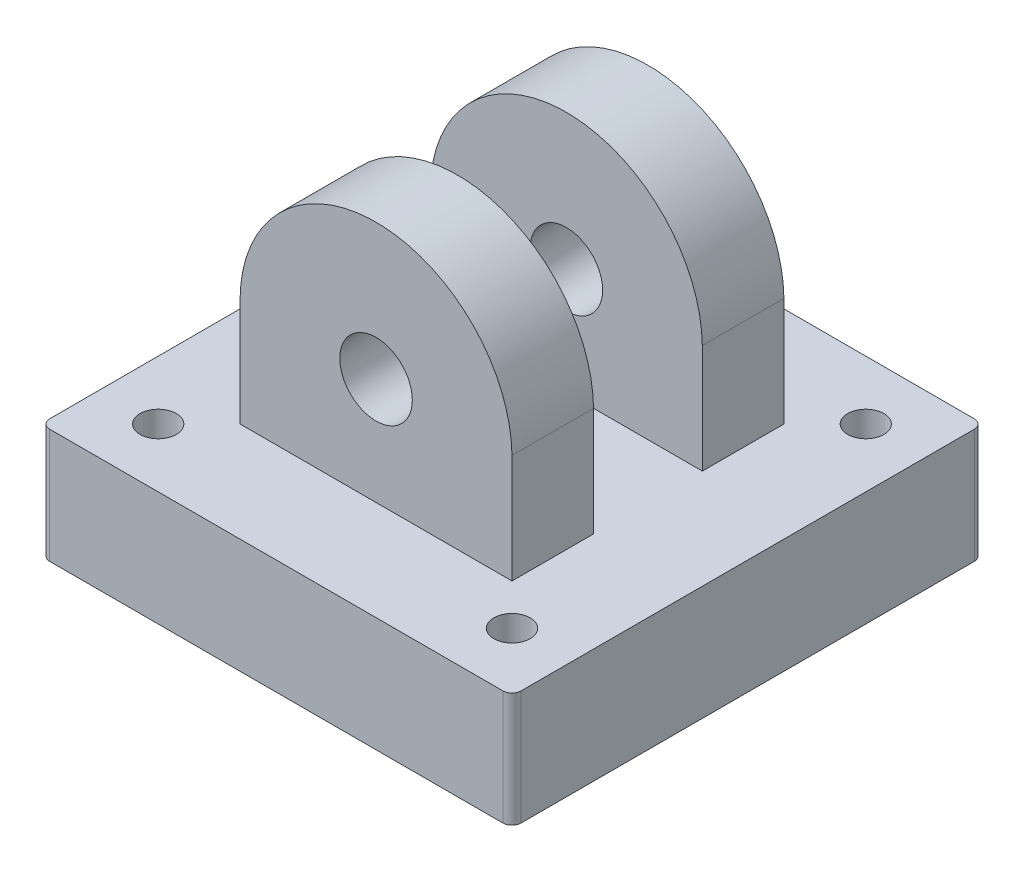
ISO-10303-21;
HEADER;
FILE_DESCRIPTION(('STEP AP214'),'2;1');
FILE_NAME('part.step','',(''),(''),'','','');
FILE_SCHEMA(('AUTOMOTIVE_DESIGN { 1 0 10303 214 1 1 1 1 }'));
ENDSEC;
DATA;
#1=APPLICATION_CONTEXT('core data for automotive mechanical design processes');
#2=APPLICATION_PROTOCOL_DEFINITION('international standard','automotive_design',2000,#1);
#3=PRODUCT_CONTEXT('',#1,'mechanical');
#4=PRODUCT('Part','Part','',(#3));
#5=PRODUCT_RELATED_PRODUCT_CATEGORY('part','',(#4));
#6=PRODUCT_DEFINITION_FORMATION('','',#4);
#7=PRODUCT_DEFINITION_CONTEXT('part definition',#1,'design');
#8=PRODUCT_DEFINITION('design','',#6,#7);
#9=PRODUCT_DEFINITION_SHAPE('','',#8);
#10=(LENGTH_UNIT() NAMED_UNIT(*) SI_UNIT(.MILLI.,.METRE.));
#11=(NAMED_UNIT(*) PLANE_ANGLE_UNIT() SI_UNIT($,.RADIAN.));
#12=(NAMED_UNIT(*) SI_UNIT($,.STERADIAN.) SOLID_ANGLE_UNIT());
#13=UNCERTAINTY_MEASURE_WITH_UNIT(LENGTH_MEASURE(1.E-05),#10,'distance_accuracy_value','');
#14=(GEOMETRIC_REPRESENTATION_CONTEXT(3) GLOBAL_UNCERTAINTY_ASSIGNED_CONTEXT((#13)) GLOBAL_UNIT_ASSIGNED_CONTEXT((#10,
#11,#12)) REPRESENTATION_CONTEXT('',''));
#15=CARTESIAN_POINT('',(0.,0.,0.));
#16=DIRECTION('',(0.,0.,1.));
#17=DIRECTION('',(1.,0.,0.));
#18=AXIS2_PLACEMENT_3D('',#15,#16,#17);
#19=CARTESIAN_POINT('',(47.625,76.2,-47.625));
#20=DIRECTION('',(-1.,0.,0.));
#21=DIRECTION('',(0.,0.,1.));
#22=AXIS2_PLACEMENT_3D('',#19,#20,#21);
#23=PLANE('',#22);
#24=DIRECTION('',(0.,0.,-1.));
#25=VECTOR('',#24,1.);
#26=CARTESIAN_POINT('',(47.625,76.2,-47.625));
#27=LINE('',#26,#25);
#28=CARTESIAN_POINT('',(47.625,76.2,-19.045));
#29=VERTEX_POINT('',#28);
#30=CARTESIAN_POINT('',(47.625,76.2,-47.625));
#31=VERTEX_POINT('',#30);
#32=EDGE_CURVE('E185',#29,#31,#27,.T.);
#33=ORIENTED_EDGE('',*,*,#32,.F.);
#34=DIRECTION('',(0.,-1.,0.));
#35=VECTOR('',#34,1.);
#36=CARTESIAN_POINT('',(47.625,76.2,-19.045));
#37=LINE('',#36,#35);
#38=CARTESIAN_POINT('',(47.625,38.1,-19.045));
#39=VERTEX_POINT('',#38);
#40=EDGE_CURVE('E352',#29,#39,#37,.T.);
#41=ORIENTED_EDGE('',*,*,#40,.T.);
#42=DIRECTION('',(0.,0.,-1.));
#43=VECTOR('',#42,1.);
#44=CARTESIAN_POINT('',(47.625,38.1,-47.625));
#45=LINE('',#44,#43);
#46=CARTESIAN_POINT('',(47.625,38.1,-47.625));
#47=VERTEX_POINT('',#46);
#48=EDGE_CURVE('E163',#39,#47,#45,.T.);
#49=ORIENTED_EDGE('',*,*,#48,.T.);
#50=DIRECTION('',(0.,-1.,0.));
#51=VECTOR('',#50,1.);
#52=CARTESIAN_POINT('',(47.625,76.2,-47.625));
#53=LINE('',#52,#51);
#54=EDGE_CURVE('E199',#31,#47,#53,.T.);
#55=ORIENTED_EDGE('',*,*,#54,.F.);
#56=EDGE_LOOP('',(#33,#41,#49,#55));
#57=FACE_BOUND('',#56,.T.);
#58=ADVANCED_FACE('F35',(#57),#23,.F.);
#59=CARTESIAN_POINT('',(-47.625,76.2,-47.625));
#60=DIRECTION('',(1.,0.,0.));
#61=DIRECTION('',(0.,0.,-1.));
#62=AXIS2_PLACEMENT_3D('',#59,#60,#61);
#63=PLANE('',#62);
#64=DIRECTION('',(0.,0.,1.));
#65=VECTOR('',#64,1.);
#66=CARTESIAN_POINT('',(-47.625,38.1,-47.625));
#67=LINE('',#66,#65);
#68=CARTESIAN_POINT('',(-47.625,38.1,-47.625));
#69=VERTEX_POINT('',#68);
#70=CARTESIAN_POINT('',(-47.625,38.1,-19.045));
#71=VERTEX_POINT('',#70);
#72=EDGE_CURVE('E162',#69,#71,#67,.T.);
#73=ORIENTED_EDGE('',*,*,#72,.T.);
#74=DIRECTION('',(0.,-1.,0.));
#75=VECTOR('',#74,1.);
#76=CARTESIAN_POINT('',(-47.625,38.1,-19.045));
#77=LINE('',#76,#75);
#78=CARTESIAN_POINT('',(-47.625,76.1999999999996,-19.045));
#79=VERTEX_POINT('',#78);
#80=EDGE_CURVE('E171',#79,#71,#77,.T.);
#81=ORIENTED_EDGE('',*,*,#80,.F.);
#82=DIRECTION('',(0.,0.,1.));
#83=VECTOR('',#82,1.);
#84=CARTESIAN_POINT('',(-47.625,76.2,-47.625));
#85=LINE('',#84,#83);
#86=CARTESIAN_POINT('',(-47.625,76.2,-47.625));
#87=VERTEX_POINT('',#86);
#88=EDGE_CURVE('E195',#87,#79,#85,.T.);
#89=ORIENTED_EDGE('',*,*,#88,.F.);
#90=DIRECTION('',(0.,-1.,0.));
#91=VECTOR('',#90,1.);
#92=CARTESIAN_POINT('',(-47.625,76.2,-47.625));
#93=LINE('',#92,#91);
#94=EDGE_CURVE('E181',#87,#69,#93,.T.);
#95=ORIENTED_EDGE('',*,*,#94,.T.);
#96=EDGE_LOOP('',(#73,#81,#89,#95));
#97=FACE_BOUND('',#96,.T.);
#98=ADVANCED_FACE('F180',(#97),#63,.F.);
#99=CARTESIAN_POINT('',(0.,75.5098732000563,-47.625));
#100=DIRECTION('',(0.,0.,1.));
#101=DIRECTION('',(1.,0.,0.));
#102=AXIS2_PLACEMENT_3D('',#99,#100,#101);
#103=CYLINDRICAL_SURFACE('',#102,47.63);
#104=CARTESIAN_POINT('',(0.,75.5098732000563,-19.045));
#105=DIRECTION('',(0.,0.,-1.));
#106=DIRECTION('',(-1.,0.,0.));
#107=AXIS2_PLACEMENT_3D('',#104,#105,#106);
#108=CIRCLE('',#107,47.63);
#109=EDGE_CURVE('E173',#29,#79,#108,.F.);
#110=ORIENTED_EDGE('',*,*,#109,.F.);
#111=ORIENTED_EDGE('',*,*,#32,.T.);
#112=CARTESIAN_POINT('',(0.,75.5098732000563,-47.625));
#113=DIRECTION('',(0.,0.,1.));
#114=DIRECTION('',(1.,0.,0.));
#115=AXIS2_PLACEMENT_3D('',#112,#113,#114);
#116=CIRCLE('',#115,47.63);
#117=EDGE_CURVE('E335',#31,#87,#116,.T.);
#118=ORIENTED_EDGE('',*,*,#117,.T.);
#119=ORIENTED_EDGE('',*,*,#88,.T.);
#120=EDGE_LOOP('',(#110,#111,#118,#119));
#121=FACE_BOUND('',#120,.T.);
#122=ADVANCED_FACE('F308',(#121),#103,.T.);
#123=CARTESIAN_POINT('',(0.,75.5098732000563,-82.55));
#124=DIRECTION('',(0.,0.,1.));
#125=DIRECTION('',(1.,0.,0.));
#126=AXIS2_PLACEMENT_3D('',#123,#124,#125);
#127=CYLINDRICAL_SURFACE('',#126,12.7);
#128=CARTESIAN_POINT('',(0.,75.5098732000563,-19.045));
#129=DIRECTION('',(0.,0.,-1.));
#130=DIRECTION('',(-1.,0.,0.));
#131=AXIS2_PLACEMENT_3D('',#128,#129,#130);
#132=CIRCLE('',#131,12.7);
#133=CARTESIAN_POINT('',(-12.7,75.5098732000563,-19.045));
#134=VERTEX_POINT('',#133);
#135=EDGE_CURVE('E230',#134,#134,#132,.F.);
#136=ORIENTED_EDGE('',*,*,#135,.T.);
#137=EDGE_LOOP('',(#136));
#138=FACE_BOUND('',#137,.T.);
#139=CARTESIAN_POINT('',(0.,75.5098732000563,-47.625));
#140=DIRECTION('',(0.,0.,1.));
#141=DIRECTION('',(1.,0.,0.));
#142=AXIS2_PLACEMENT_3D('',#139,#140,#141);
#143=CIRCLE('',#142,12.7);
#144=CARTESIAN_POINT('',(12.7,75.5098732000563,-47.625));
#145=VERTEX_POINT('',#144);
#146=EDGE_CURVE('E344',#145,#145,#143,.T.);
#147=ORIENTED_EDGE('',*,*,#146,.F.);
#148=EDGE_LOOP('',(#147));
#149=FACE_BOUND('',#148,.T.);
#150=ADVANCED_FACE('F536',(#138,#149),#127,.F.);
#151=CARTESIAN_POINT('',(0.,38.1,0.));
#152=DIRECTION('',(0.,1.,0.));
#153=DIRECTION('',(0.,0.,1.));
#154=AXIS2_PLACEMENT_3D('',#151,#152,#153);
#155=PLANE('',#154);
#156=CARTESIAN_POINT('',(61.9637672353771,38.1,61.9637672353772));
#157=DIRECTION('',(0.,1.,0.));
#158=DIRECTION('',(0.,0.,1.));
#159=AXIS2_PLACEMENT_3D('',#156,#157,#158);
#160=CIRCLE('',#159,6.35);
#161=CARTESIAN_POINT('',(61.9637672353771,38.1,68.3137672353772));
#162=VERTEX_POINT('',#161);
#163=EDGE_CURVE('E388',#162,#162,#160,.T.);
#164=ORIENTED_EDGE('',*,*,#163,.F.);
#165=EDGE_LOOP('',(#164));
#166=FACE_BOUND('',#165,.T.);
#167=CARTESIAN_POINT('',(61.9637672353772,38.1,-61.9637672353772));
#168=DIRECTION('',(0.,1.,0.));
#169=DIRECTION('',(0.,0.,1.));
#170=AXIS2_PLACEMENT_3D('',#167,#168,#169);
#171=CIRCLE('',#170,6.35);
#172=CARTESIAN_POINT('',(61.9637672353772,38.1,-55.6137672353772));
#173=VERTEX_POINT('',#172);
#174=EDGE_CURVE('E391',#173,#173,#171,.T.);
#175=ORIENTED_EDGE('',*,*,#174,.F.);
#176=EDGE_LOOP('',(#175));
#177=FACE_BOUND('',#176,.T.);
#178=CARTESIAN_POINT('',(-61.9637672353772,38.1,-61.9637672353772));
#179=DIRECTION('',(0.,1.,0.));
#180=DIRECTION('',(0.,0.,1.));
#181=AXIS2_PLACEMENT_3D('',#178,#179,#180);
#182=CIRCLE('',#181,6.35);
#183=CARTESIAN_POINT('',(-61.9637672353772,38.1,-55.6137672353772));
#184=VERTEX_POINT('',#183);
#185=EDGE_CURVE('E394',#184,#184,#182,.T.);
#186=ORIENTED_EDGE('',*,*,#185,.F.);
#187=EDGE_LOOP('',(#186));
#188=FACE_BOUND('',#187,.T.);
#189=CARTESIAN_POINT('',(-61.9637672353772,38.1,61.9637672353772));
#190=DIRECTION('',(0.,1.,0.));
#191=DIRECTION('',(0.,0.,1.));
#192=AXIS2_PLACEMENT_3D('',#189,#190,#191);
#193=CIRCLE('',#192,6.35);
#194=CARTESIAN_POINT('',(-61.9637672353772,38.1,68.3137672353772));
#195=VERTEX_POINT('',#194);
#196=EDGE_CURVE('E382',#195,#195,#193,.T.);
#197=ORIENTED_EDGE('',*,*,#196,.F.);
#198=EDGE_LOOP('',(#197));
#199=FACE_BOUND('',#198,.T.);
#200=ORIENTED_EDGE('',*,*,#48,.F.);
#201=DIRECTION('',(-1.,0.,0.));
#202=VECTOR('',#201,1.);
#203=CARTESIAN_POINT('',(82.55,38.1,-19.045));
#204=LINE('',#203,#202);
#205=EDGE_CURVE('E156',#39,#71,#204,.T.);
#206=ORIENTED_EDGE('',*,*,#205,.T.);
#207=ORIENTED_EDGE('',*,*,#72,.F.);
#208=DIRECTION('',(-1.,0.,0.));
#209=VECTOR('',#208,1.);
#210=CARTESIAN_POINT('',(-47.625,38.1,-47.625));
#211=LINE('',#210,#209);
#212=EDGE_CURVE('E187',#47,#69,#211,.T.);
#213=ORIENTED_EDGE('',*,*,#212,.F.);
#214=EDGE_LOOP('',(#200,#206,#207,#213));
#215=FACE_BOUND('',#214,.T.);
#216=DIRECTION('',(0.,0.,-1.));
#217=VECTOR('',#216,1.);
#218=CARTESIAN_POINT('',(82.55,38.1,-82.55));
#219=LINE('',#218,#217);
#220=CARTESIAN_POINT('',(82.55,38.1,79.375));
#221=VERTEX_POINT('',#220);
#222=CARTESIAN_POINT('',(82.55,38.1,-79.375));
#223=VERTEX_POINT('',#222);
#224=EDGE_CURVE('E202',#221,#223,#219,.T.);
#225=ORIENTED_EDGE('',*,*,#224,.T.);
#226=CARTESIAN_POINT('',(79.375,38.1,-79.375));
#227=DIRECTION('',(0.,1.,0.));
#228=DIRECTION('',(0.,0.,1.));
#229=AXIS2_PLACEMENT_3D('',#226,#227,#228);
#230=CIRCLE('',#229,3.175);
#231=CARTESIAN_POINT('',(79.375,38.1,-82.55));
#232=VERTEX_POINT('',#231);
#233=EDGE_CURVE('E244',#223,#232,#230,.T.);
#234=ORIENTED_EDGE('',*,*,#233,.T.);
#235=DIRECTION('',(-1.,0.,0.));
#236=VECTOR('',#235,1.);
#237=CARTESIAN_POINT('',(-82.55,38.1,-82.55));
#238=LINE('',#237,#236);
#239=CARTESIAN_POINT('',(-79.375,38.1,-82.55));
#240=VERTEX_POINT('',#239);
#241=EDGE_CURVE('E205',#232,#240,#238,.T.);
#242=ORIENTED_EDGE('',*,*,#241,.T.);
#243=CARTESIAN_POINT('',(-79.375,38.1,-79.375));
#244=DIRECTION('',(0.,1.,0.));
#245=DIRECTION('',(0.,0.,1.));
#246=AXIS2_PLACEMENT_3D('',#243,#244,#245);
#247=CIRCLE('',#246,3.175);
#248=CARTESIAN_POINT('',(-82.55,38.1,-79.375));
#249=VERTEX_POINT('',#248);
#250=EDGE_CURVE('E242',#240,#249,#247,.T.);
#251=ORIENTED_EDGE('',*,*,#250,.T.);
#252=DIRECTION('',(0.,0.,1.));
#253=VECTOR('',#252,1.);
#254=CARTESIAN_POINT('',(-82.55,38.1,-82.55));
#255=LINE('',#254,#253);
#256=CARTESIAN_POINT('',(-82.55,38.1,79.375));
#257=VERTEX_POINT('',#256);
#258=EDGE_CURVE('E208',#249,#257,#255,.T.);
#259=ORIENTED_EDGE('',*,*,#258,.T.);
#260=CARTESIAN_POINT('',(-79.375,38.1,79.375));
#261=DIRECTION('',(0.,1.,0.));
#262=DIRECTION('',(0.,0.,1.));
#263=AXIS2_PLACEMENT_3D('',#260,#261,#262);
#264=CIRCLE('',#263,3.175);
#265=CARTESIAN_POINT('',(-79.375,38.1,82.55));
#266=VERTEX_POINT('',#265);
#267=EDGE_CURVE('E238',#257,#266,#264,.T.);
#268=ORIENTED_EDGE('',*,*,#267,.T.);
#269=DIRECTION('',(1.,0.,0.));
#270=VECTOR('',#269,1.);
#271=CARTESIAN_POINT('',(-82.55,38.1,82.55));
#272=LINE('',#271,#270);
#273=CARTESIAN_POINT('',(79.375,38.1,82.55));
#274=VERTEX_POINT('',#273);
#275=EDGE_CURVE('E211',#266,#274,#272,.T.);
#276=ORIENTED_EDGE('',*,*,#275,.T.);
#277=CARTESIAN_POINT('',(79.375,38.1,79.375));
#278=DIRECTION('',(0.,1.,0.));
#279=DIRECTION('',(0.,0.,1.));
#280=AXIS2_PLACEMENT_3D('',#277,#278,#279);
#281=CIRCLE('',#280,3.175);
#282=EDGE_CURVE('E240',#274,#221,#281,.T.);
#283=ORIENTED_EDGE('',*,*,#282,.T.);
#284=EDGE_LOOP('',(#225,#234,#242,#251,#259,#268,#276,#283));
#285=FACE_BOUND('',#284,.T.);
#286=DIRECTION('',(-1.,0.,0.));
#287=VECTOR('',#286,1.);
#288=CARTESIAN_POINT('',(82.55,38.1,19.055));
#289=LINE('',#288,#287);
#290=CARTESIAN_POINT('',(47.625,38.1,19.055));
#291=VERTEX_POINT('',#290);
#292=CARTESIAN_POINT('',(-47.625,38.1,19.055));
#293=VERTEX_POINT('',#292);
#294=EDGE_CURVE('E167',#291,#293,#289,.T.);
#295=ORIENTED_EDGE('',*,*,#294,.F.);
#296=CARTESIAN_POINT('',(47.625,38.1,47.625));
#297=VERTEX_POINT('',#296);
#298=EDGE_CURVE('E329',#297,#291,#45,.T.);
#299=ORIENTED_EDGE('',*,*,#298,.F.);
#300=DIRECTION('',(1.,0.,0.));
#301=VECTOR('',#300,1.);
#302=CARTESIAN_POINT('',(-47.625,38.1,47.625));
#303=LINE('',#302,#301);
#304=CARTESIAN_POINT('',(-47.625,38.1,47.625));
#305=VERTEX_POINT('',#304);
#306=EDGE_CURVE('E182',#305,#297,#303,.T.);
#307=ORIENTED_EDGE('',*,*,#306,.F.);
#308=EDGE_CURVE('E183',#293,#305,#67,.T.);
#309=ORIENTED_EDGE('',*,*,#308,.F.);
#310=EDGE_LOOP('',(#295,#299,#307,#309));
#311=FACE_BOUND('',#310,.T.);
#312=ADVANCED_FACE('F158',(#166,#177,#188,#199,#215,#285,#311),#155,.T.);
#313=CARTESIAN_POINT('',(82.55,-2.,-82.55));
#314=DIRECTION('',(1.,0.,0.));
#315=DIRECTION('',(0.,0.,-1.));
#316=AXIS2_PLACEMENT_3D('',#313,#314,#315);
#317=PLANE('',#316);
#318=DIRECTION('',(0.,0.,-1.));
#319=VECTOR('',#318,1.);
#320=CARTESIAN_POINT('',(82.55,-2.,-82.55));
#321=LINE('',#320,#319);
#322=CARTESIAN_POINT('',(82.55,-2.,79.375));
#323=VERTEX_POINT('',#322);
#324=CARTESIAN_POINT('',(82.55,-2.,-79.375));
#325=VERTEX_POINT('',#324);
#326=EDGE_CURVE('E214',#323,#325,#321,.T.);
#327=ORIENTED_EDGE('',*,*,#326,.T.);
#328=DIRECTION('',(0.,1.,0.));
#329=VECTOR('',#328,1.);
#330=CARTESIAN_POINT('',(82.55,-2.,-79.375));
#331=LINE('',#330,#329);
#332=EDGE_CURVE('E235',#325,#223,#331,.T.);
#333=ORIENTED_EDGE('',*,*,#332,.T.);
#334=ORIENTED_EDGE('',*,*,#224,.F.);
#335=DIRECTION('',(0.,1.,0.));
#336=VECTOR('',#335,1.);
#337=CARTESIAN_POINT('',(82.55,-2.,79.375));
#338=LINE('',#337,#336);
#339=EDGE_CURVE('E225',#221,#323,#338,.F.);
#340=ORIENTED_EDGE('',*,*,#339,.T.);
#341=EDGE_LOOP('',(#327,#333,#334,#340));
#342=FACE_BOUND('',#341,.T.);
#343=ADVANCED_FACE('F428',(#342),#317,.T.);
#344=CARTESIAN_POINT('',(-82.55,-2.,82.55));
#345=DIRECTION('',(0.,0.,1.));
#346=DIRECTION('',(1.,0.,0.));
#347=AXIS2_PLACEMENT_3D('',#344,#345,#346);
#348=PLANE('',#347);
#349=DIRECTION('',(1.,0.,0.));
#350=VECTOR('',#349,1.);
#351=CARTESIAN_POINT('',(-82.55,-2.,82.55));
#352=LINE('',#351,#350);
#353=CARTESIAN_POINT('',(-79.375,-2.,82.55));
#354=VERTEX_POINT('',#353);
#355=CARTESIAN_POINT('',(79.375,-2.,82.55));
#356=VERTEX_POINT('',#355);
#357=EDGE_CURVE('E222',#354,#356,#352,.T.);
#358=ORIENTED_EDGE('',*,*,#357,.T.);
#359=DIRECTION('',(0.,1.,0.));
#360=VECTOR('',#359,1.);
#361=CARTESIAN_POINT('',(79.375,-2.,82.55));
#362=LINE('',#361,#360);
#363=EDGE_CURVE('E11',#356,#274,#362,.T.);
#364=ORIENTED_EDGE('',*,*,#363,.T.);
#365=ORIENTED_EDGE('',*,*,#275,.F.);
#366=DIRECTION('',(0.,1.,0.));
#367=VECTOR('',#366,1.);
#368=CARTESIAN_POINT('',(-79.375,-2.,82.55));
#369=LINE('',#368,#367);
#370=EDGE_CURVE('E48',#266,#354,#369,.F.);
#371=ORIENTED_EDGE('',*,*,#370,.T.);
#372=EDGE_LOOP('',(#358,#364,#365,#371));
#373=FACE_BOUND('',#372,.T.);
#374=ADVANCED_FACE('F437',(#373),#348,.T.);
#375=CARTESIAN_POINT('',(-82.55,-2.,-82.55));
#376=DIRECTION('',(-1.,0.,0.));
#377=DIRECTION('',(0.,0.,1.));
#378=AXIS2_PLACEMENT_3D('',#375,#376,#377);
#379=PLANE('',#378);
#380=CARTESIAN_POINT('',(-82.55,18.05,0.));
#381=DIRECTION('',(-1.,0.,0.));
#382=DIRECTION('',(0.,0.,1.));
#383=AXIS2_PLACEMENT_3D('',#380,#381,#382);
#384=CIRCLE('',#383,11.0871);
#385=CARTESIAN_POINT('',(-82.55,18.05,11.0871));
#386=VERTEX_POINT('',#385);
#387=EDGE_CURVE('E376',#386,#386,#384,.T.);
#388=ORIENTED_EDGE('',*,*,#387,.F.);
#389=EDGE_LOOP('',(#388));
#390=FACE_BOUND('',#389,.T.);
#391=ORIENTED_EDGE('',*,*,#258,.F.);
#392=DIRECTION('',(0.,1.,0.));
#393=VECTOR('',#392,1.);
#394=CARTESIAN_POINT('',(-82.55,-2.,-79.375));
#395=LINE('',#394,#393);
#396=CARTESIAN_POINT('',(-82.55,-2.,-79.375));
#397=VERTEX_POINT('',#396);
#398=EDGE_CURVE('E63',#249,#397,#395,.F.);
#399=ORIENTED_EDGE('',*,*,#398,.T.);
#400=DIRECTION('',(0.,0.,1.));
#401=VECTOR('',#400,1.);
#402=CARTESIAN_POINT('',(-82.55,-2.,-82.55));
#403=LINE('',#402,#401);
#404=CARTESIAN_POINT('',(-82.55,-2.,79.375));
#405=VERTEX_POINT('',#404);
#406=EDGE_CURVE('E220',#397,#405,#403,.T.);
#407=ORIENTED_EDGE('',*,*,#406,.T.);
#408=DIRECTION('',(0.,1.,0.));
#409=VECTOR('',#408,1.);
#410=CARTESIAN_POINT('',(-82.55,-2.,79.375));
#411=LINE('',#410,#409);
#412=EDGE_CURVE('E258',#405,#257,#411,.T.);
#413=ORIENTED_EDGE('',*,*,#412,.T.);
#414=EDGE_LOOP('',(#391,#399,#407,#413));
#415=FACE_BOUND('',#414,.T.);
#416=ADVANCED_FACE('F441',(#390,#415),#379,.T.);
#417=CARTESIAN_POINT('',(-82.55,-2.,-82.55));
#418=DIRECTION('',(0.,0.,-1.));
#419=DIRECTION('',(-1.,0.,0.));
#420=AXIS2_PLACEMENT_3D('',#417,#418,#419);
#421=PLANE('',#420);
#422=ORIENTED_EDGE('',*,*,#241,.F.);
#423=DIRECTION('',(0.,1.,0.));
#424=VECTOR('',#423,1.);
#425=CARTESIAN_POINT('',(79.375,-2.,-82.55));
#426=LINE('',#425,#424);
#427=CARTESIAN_POINT('',(79.375,-2.,-82.55));
#428=VERTEX_POINT('',#427);
#429=EDGE_CURVE('E249',#232,#428,#426,.F.);
#430=ORIENTED_EDGE('',*,*,#429,.T.);
#431=DIRECTION('',(-1.,0.,0.));
#432=VECTOR('',#431,1.);
#433=CARTESIAN_POINT('',(-82.55,-2.,-82.55));
#434=LINE('',#433,#432);
#435=CARTESIAN_POINT('',(-79.375,-2.,-82.55));
#436=VERTEX_POINT('',#435);
#437=EDGE_CURVE('E217',#428,#436,#434,.T.);
#438=ORIENTED_EDGE('',*,*,#437,.T.);
#439=DIRECTION('',(0.,1.,0.));
#440=VECTOR('',#439,1.);
#441=CARTESIAN_POINT('',(-79.375,-2.,-82.55));
#442=LINE('',#441,#440);
#443=EDGE_CURVE('E246',#436,#240,#442,.T.);
#444=ORIENTED_EDGE('',*,*,#443,.T.);
#445=EDGE_LOOP('',(#422,#430,#438,#444));
#446=FACE_BOUND('',#445,.T.);
#447=ADVANCED_FACE('F323',(#446),#421,.T.);
#448=CARTESIAN_POINT('',(0.,-2.,0.));
#449=DIRECTION('',(0.,1.,0.));
#450=DIRECTION('',(0.,0.,1.));
#451=AXIS2_PLACEMENT_3D('',#448,#449,#450);
#452=PLANE('',#451);
#453=CARTESIAN_POINT('',(61.9637672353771,-2.,61.9637672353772));
#454=DIRECTION('',(0.,-1.,0.));
#455=DIRECTION('',(0.,0.,-1.));
#456=AXIS2_PLACEMENT_3D('',#453,#454,#455);
#457=CIRCLE('',#456,6.35);
#458=CARTESIAN_POINT('',(61.9637672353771,-2.,55.6137672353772));
#459=VERTEX_POINT('',#458);
#460=EDGE_CURVE('E397',#459,#459,#457,.T.);
#461=ORIENTED_EDGE('',*,*,#460,.F.);
#462=EDGE_LOOP('',(#461));
#463=FACE_BOUND('',#462,.T.);
#464=CARTESIAN_POINT('',(61.9637672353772,-2.,-61.9637672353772));
#465=DIRECTION('',(0.,-1.,0.));
#466=DIRECTION('',(0.,0.,-1.));
#467=AXIS2_PLACEMENT_3D('',#464,#465,#466);
#468=CIRCLE('',#467,6.35);
#469=CARTESIAN_POINT('',(61.9637672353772,-2.,-68.3137672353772));
#470=VERTEX_POINT('',#469);
#471=EDGE_CURVE('E401',#470,#470,#468,.T.);
#472=ORIENTED_EDGE('',*,*,#471,.F.);
#473=EDGE_LOOP('',(#472));
#474=FACE_BOUND('',#473,.T.);
#475=CARTESIAN_POINT('',(-61.9637672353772,-2.,-61.9637672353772));
#476=DIRECTION('',(0.,-1.,0.));
#477=DIRECTION('',(0.,0.,-1.));
#478=AXIS2_PLACEMENT_3D('',#475,#476,#477);
#479=CIRCLE('',#478,6.35);
#480=CARTESIAN_POINT('',(-61.9637672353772,-2.,-68.3137672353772));
#481=VERTEX_POINT('',#480);
#482=EDGE_CURVE('E398',#481,#481,#479,.T.);
#483=ORIENTED_EDGE('',*,*,#482,.F.);
#484=EDGE_LOOP('',(#483));
#485=FACE_BOUND('',#484,.T.);
#486=CARTESIAN_POINT('',(-61.9637672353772,-2.,61.9637672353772));
#487=DIRECTION('',(0.,-1.,0.));
#488=DIRECTION('',(0.,0.,-1.));
#489=AXIS2_PLACEMENT_3D('',#486,#487,#488);
#490=CIRCLE('',#489,6.35);
#491=CARTESIAN_POINT('',(-61.9637672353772,-2.,55.6137672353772));
#492=VERTEX_POINT('',#491);
#493=EDGE_CURVE('E385',#492,#492,#490,.T.);
#494=ORIENTED_EDGE('',*,*,#493,.F.);
#495=EDGE_LOOP('',(#494));
#496=FACE_BOUND('',#495,.T.);
#497=CARTESIAN_POINT('',(0.,-2.,0.));
#498=DIRECTION('',(0.,-1.,0.));
#499=DIRECTION('',(0.,0.,-1.));
#500=AXIS2_PLACEMENT_3D('',#497,#498,#499);
#501=CIRCLE('',#500,76.2);
#502=CARTESIAN_POINT('',(0.,-2.,-76.2));
#503=VERTEX_POINT('',#502);
#504=EDGE_CURVE('E364',#503,#503,#501,.T.);
#505=ORIENTED_EDGE('',*,*,#504,.F.);
#506=EDGE_LOOP('',(#505));
#507=FACE_BOUND('',#506,.T.);
#508=ORIENTED_EDGE('',*,*,#437,.F.);
#509=CARTESIAN_POINT('',(79.375,-2.,-79.375));
#510=DIRECTION('',(0.,1.,0.));
#511=DIRECTION('',(0.,0.,1.));
#512=AXIS2_PLACEMENT_3D('',#509,#510,#511);
#513=CIRCLE('',#512,3.175);
#514=EDGE_CURVE('E256',#428,#325,#513,.F.);
#515=ORIENTED_EDGE('',*,*,#514,.T.);
#516=ORIENTED_EDGE('',*,*,#326,.F.);
#517=CARTESIAN_POINT('',(79.375,-2.,79.375));
#518=DIRECTION('',(0.,1.,0.));
#519=DIRECTION('',(0.,0.,1.));
#520=AXIS2_PLACEMENT_3D('',#517,#518,#519);
#521=CIRCLE('',#520,3.175);
#522=EDGE_CURVE('E252',#323,#356,#521,.F.);
#523=ORIENTED_EDGE('',*,*,#522,.T.);
#524=ORIENTED_EDGE('',*,*,#357,.F.);
#525=CARTESIAN_POINT('',(-79.375,-2.,79.375));
#526=DIRECTION('',(0.,1.,0.));
#527=DIRECTION('',(0.,0.,1.));
#528=AXIS2_PLACEMENT_3D('',#525,#526,#527);
#529=CIRCLE('',#528,3.175);
#530=EDGE_CURVE('E56',#354,#405,#529,.F.);
#531=ORIENTED_EDGE('',*,*,#530,.T.);
#532=ORIENTED_EDGE('',*,*,#406,.F.);
#533=CARTESIAN_POINT('',(-79.375,-2.,-79.375));
#534=DIRECTION('',(0.,1.,0.));
#535=DIRECTION('',(0.,0.,1.));
#536=AXIS2_PLACEMENT_3D('',#533,#534,#535);
#537=CIRCLE('',#536,3.175);
#538=EDGE_CURVE('E254',#397,#436,#537,.F.);
#539=ORIENTED_EDGE('',*,*,#538,.T.);
#540=EDGE_LOOP('',(#508,#515,#516,#523,#524,#531,#532,#539));
#541=FACE_BOUND('',#540,.T.);
#542=ADVANCED_FACE('F316',(#463,#474,#485,#496,#507,#541),#452,.F.);
#543=ORIENTED_EDGE('',*,*,#298,.T.);
#544=DIRECTION('',(0.,1.,0.));
#545=VECTOR('',#544,1.);
#546=CARTESIAN_POINT('',(47.625,76.2,19.055));
#547=LINE('',#546,#545);
#548=CARTESIAN_POINT('',(47.625,76.2,19.055));
#549=VERTEX_POINT('',#548);
#550=EDGE_CURVE('E233',#291,#549,#547,.T.);
#551=ORIENTED_EDGE('',*,*,#550,.T.);
#552=CARTESIAN_POINT('',(47.625,76.2,47.625));
#553=VERTEX_POINT('',#552);
#554=EDGE_CURVE('E339',#553,#549,#27,.T.);
#555=ORIENTED_EDGE('',*,*,#554,.F.);
#556=DIRECTION('',(0.,-1.,0.));
#557=VECTOR('',#556,1.);
#558=CARTESIAN_POINT('',(47.625,76.2,47.625));
#559=LINE('',#558,#557);
#560=EDGE_CURVE('E191',#553,#297,#559,.T.);
#561=ORIENTED_EDGE('',*,*,#560,.T.);
#562=EDGE_LOOP('',(#543,#551,#555,#561));
#563=FACE_BOUND('',#562,.T.);
#564=ADVANCED_FACE('F304',(#563),#23,.F.);
#565=CARTESIAN_POINT('',(-47.625,76.2,-47.625));
#566=DIRECTION('',(0.,0.,1.));
#567=DIRECTION('',(1.,0.,0.));
#568=AXIS2_PLACEMENT_3D('',#565,#566,#567);
#569=PLANE('',#568);
#570=ORIENTED_EDGE('',*,*,#146,.T.);
#571=EDGE_LOOP('',(#570));
#572=FACE_BOUND('',#571,.T.);
#573=ORIENTED_EDGE('',*,*,#212,.T.);
#574=ORIENTED_EDGE('',*,*,#94,.F.);
#575=ORIENTED_EDGE('',*,*,#117,.F.);
#576=ORIENTED_EDGE('',*,*,#54,.T.);
#577=EDGE_LOOP('',(#573,#574,#575,#576));
#578=FACE_BOUND('',#577,.T.);
#579=ADVANCED_FACE('F315',(#572,#578),#569,.F.);
#580=CARTESIAN_POINT('',(-47.625,76.1999999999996,19.055));
#581=VERTEX_POINT('',#580);
#582=CARTESIAN_POINT('',(-47.625,76.2,47.625));
#583=VERTEX_POINT('',#582);
#584=EDGE_CURVE('E338',#581,#583,#85,.T.);
#585=ORIENTED_EDGE('',*,*,#584,.F.);
#586=DIRECTION('',(0.,1.,0.));
#587=VECTOR('',#586,1.);
#588=CARTESIAN_POINT('',(-47.625,38.1,19.055));
#589=LINE('',#588,#587);
#590=EDGE_CURVE('E168',#293,#581,#589,.T.);
#591=ORIENTED_EDGE('',*,*,#590,.F.);
#592=ORIENTED_EDGE('',*,*,#308,.T.);
#593=DIRECTION('',(0.,-1.,0.));
#594=VECTOR('',#593,1.);
#595=CARTESIAN_POINT('',(-47.625,76.2,47.625));
#596=LINE('',#595,#594);
#597=EDGE_CURVE('E194',#583,#305,#596,.T.);
#598=ORIENTED_EDGE('',*,*,#597,.F.);
#599=EDGE_LOOP('',(#585,#591,#592,#598));
#600=FACE_BOUND('',#599,.T.);
#601=ADVANCED_FACE('F310',(#600),#63,.F.);
#602=CARTESIAN_POINT('',(-47.625,76.2,47.625));
#603=DIRECTION('',(0.,0.,-1.));
#604=DIRECTION('',(-1.,0.,0.));
#605=AXIS2_PLACEMENT_3D('',#602,#603,#604);
#606=PLANE('',#605);
#607=CARTESIAN_POINT('',(0.,75.5098732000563,47.625));
#608=DIRECTION('',(0.,0.,1.));
#609=DIRECTION('',(1.,0.,0.));
#610=AXIS2_PLACEMENT_3D('',#607,#608,#609);
#611=CIRCLE('',#610,12.7);
#612=CARTESIAN_POINT('',(12.7,75.5098732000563,47.625));
#613=VERTEX_POINT('',#612);
#614=EDGE_CURVE('E349',#613,#613,#611,.T.);
#615=ORIENTED_EDGE('',*,*,#614,.F.);
#616=EDGE_LOOP('',(#615));
#617=FACE_BOUND('',#616,.T.);
#618=ORIENTED_EDGE('',*,*,#306,.T.);
#619=ORIENTED_EDGE('',*,*,#560,.F.);
#620=CARTESIAN_POINT('',(0.,75.5098732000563,47.625));
#621=DIRECTION('',(0.,0.,1.));
#622=DIRECTION('',(1.,0.,0.));
#623=AXIS2_PLACEMENT_3D('',#620,#621,#622);
#624=CIRCLE('',#623,47.63);
#625=EDGE_CURVE('E341',#553,#583,#624,.T.);
#626=ORIENTED_EDGE('',*,*,#625,.T.);
#627=ORIENTED_EDGE('',*,*,#597,.T.);
#628=EDGE_LOOP('',(#618,#619,#626,#627));
#629=FACE_BOUND('',#628,.T.);
#630=ADVANCED_FACE('F620',(#617,#629),#606,.F.);
#631=CARTESIAN_POINT('',(0.,75.5098732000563,19.055));
#632=DIRECTION('',(0.,0.,1.));
#633=DIRECTION('',(1.,0.,0.));
#634=AXIS2_PLACEMENT_3D('',#631,#632,#633);
#635=CIRCLE('',#634,47.63);
#636=EDGE_CURVE('E229',#581,#549,#635,.F.);
#637=ORIENTED_EDGE('',*,*,#636,.F.);
#638=ORIENTED_EDGE('',*,*,#584,.T.);
#639=ORIENTED_EDGE('',*,*,#625,.F.);
#640=ORIENTED_EDGE('',*,*,#554,.T.);
#641=EDGE_LOOP('',(#637,#638,#639,#640));
#642=FACE_BOUND('',#641,.T.);
#643=ADVANCED_FACE('F627',(#642),#103,.T.);
#644=CARTESIAN_POINT('',(0.,75.5098732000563,19.055));
#645=DIRECTION('',(0.,0.,1.));
#646=DIRECTION('',(1.,0.,0.));
#647=AXIS2_PLACEMENT_3D('',#644,#645,#646);
#648=CIRCLE('',#647,12.7);
#649=CARTESIAN_POINT('',(12.7,75.5098732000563,19.055));
#650=VERTEX_POINT('',#649);
#651=EDGE_CURVE('E226',#650,#650,#648,.F.);
#652=ORIENTED_EDGE('',*,*,#651,.T.);
#653=EDGE_LOOP('',(#652));
#654=FACE_BOUND('',#653,.T.);
#655=ORIENTED_EDGE('',*,*,#614,.T.);
#656=EDGE_LOOP('',(#655));
#657=FACE_BOUND('',#656,.T.);
#658=ADVANCED_FACE('F639',(#654,#657),#127,.F.);
#659=CARTESIAN_POINT('',(82.55,38.1,-19.045));
#660=DIRECTION('',(0.,0.,-1.));
#661=DIRECTION('',(-1.,0.,0.));
#662=AXIS2_PLACEMENT_3D('',#659,#660,#661);
#663=PLANE('',#662);
#664=ORIENTED_EDGE('',*,*,#135,.F.);
#665=EDGE_LOOP('',(#664));
#666=FACE_BOUND('',#665,.T.);
#667=ORIENTED_EDGE('',*,*,#40,.F.);
#668=ORIENTED_EDGE('',*,*,#109,.T.);
#669=ORIENTED_EDGE('',*,*,#80,.T.);
#670=ORIENTED_EDGE('',*,*,#205,.F.);
#671=EDGE_LOOP('',(#667,#668,#669,#670));
#672=FACE_BOUND('',#671,.T.);
#673=ADVANCED_FACE('F172',(#666,#672),#663,.F.);
#674=CARTESIAN_POINT('',(82.55,38.1,19.055));
#675=DIRECTION('',(0.,0.,1.));
#676=DIRECTION('',(1.,0.,0.));
#677=AXIS2_PLACEMENT_3D('',#674,#675,#676);
#678=PLANE('',#677);
#679=ORIENTED_EDGE('',*,*,#651,.F.);
#680=EDGE_LOOP('',(#679));
#681=FACE_BOUND('',#680,.T.);
#682=ORIENTED_EDGE('',*,*,#294,.T.);
#683=ORIENTED_EDGE('',*,*,#590,.T.);
#684=ORIENTED_EDGE('',*,*,#636,.T.);
#685=ORIENTED_EDGE('',*,*,#550,.F.);
#686=EDGE_LOOP('',(#682,#683,#684,#685));
#687=FACE_BOUND('',#686,.T.);
#688=ADVANCED_FACE('F457',(#681,#687),#678,.F.);
#689=CARTESIAN_POINT('',(79.375,-2.,-79.375));
#690=DIRECTION('',(0.,1.,0.));
#691=DIRECTION('',(0.,0.,1.));
#692=AXIS2_PLACEMENT_3D('',#689,#690,#691);
#693=CYLINDRICAL_SURFACE('',#692,3.175);
#694=ORIENTED_EDGE('',*,*,#514,.F.);
#695=ORIENTED_EDGE('',*,*,#429,.F.);
#696=ORIENTED_EDGE('',*,*,#233,.F.);
#697=ORIENTED_EDGE('',*,*,#332,.F.);
#698=EDGE_LOOP('',(#694,#695,#696,#697));
#699=FACE_BOUND('',#698,.T.);
#700=ADVANCED_FACE('F425',(#699),#693,.T.);
#701=CARTESIAN_POINT('',(-79.375,-2.,-79.375));
#702=DIRECTION('',(0.,1.,0.));
#703=DIRECTION('',(0.,0.,1.));
#704=AXIS2_PLACEMENT_3D('',#701,#702,#703);
#705=CYLINDRICAL_SURFACE('',#704,3.175);
#706=ORIENTED_EDGE('',*,*,#538,.F.);
#707=ORIENTED_EDGE('',*,*,#398,.F.);
#708=ORIENTED_EDGE('',*,*,#250,.F.);
#709=ORIENTED_EDGE('',*,*,#443,.F.);
#710=EDGE_LOOP('',(#706,#707,#708,#709));
#711=FACE_BOUND('',#710,.T.);
#712=ADVANCED_FACE('F443',(#711),#705,.T.);
#713=CARTESIAN_POINT('',(79.375,-2.,79.375));
#714=DIRECTION('',(0.,1.,0.));
#715=DIRECTION('',(0.,0.,1.));
#716=AXIS2_PLACEMENT_3D('',#713,#714,#715);
#717=CYLINDRICAL_SURFACE('',#716,3.175);
#718=ORIENTED_EDGE('',*,*,#522,.F.);
#719=ORIENTED_EDGE('',*,*,#339,.F.);
#720=ORIENTED_EDGE('',*,*,#282,.F.);
#721=ORIENTED_EDGE('',*,*,#363,.F.);
#722=EDGE_LOOP('',(#718,#719,#720,#721));
#723=FACE_BOUND('',#722,.T.);
#724=ADVANCED_FACE('F435',(#723),#717,.T.);
#725=CARTESIAN_POINT('',(-79.375,-2.,79.375));
#726=DIRECTION('',(0.,1.,0.));
#727=DIRECTION('',(0.,0.,1.));
#728=AXIS2_PLACEMENT_3D('',#725,#726,#727);
#729=CYLINDRICAL_SURFACE('',#728,3.175);
#730=ORIENTED_EDGE('',*,*,#530,.F.);
#731=ORIENTED_EDGE('',*,*,#370,.F.);
#732=ORIENTED_EDGE('',*,*,#267,.F.);
#733=ORIENTED_EDGE('',*,*,#412,.F.);
#734=EDGE_LOOP('',(#730,#731,#732,#733));
#735=FACE_BOUND('',#734,.T.);
#736=ADVANCED_FACE('F37',(#735),#729,.T.);
#737=CARTESIAN_POINT('',(0.,6.,0.));
#738=DIRECTION('',(0.,-1.,0.));
#739=DIRECTION('',(0.,0.,-1.));
#740=AXIS2_PLACEMENT_3D('',#737,#738,#739);
#741=CYLINDRICAL_SURFACE('',#740,76.2);
#742=CARTESIAN_POINT('',(0.,6.,0.));
#743=DIRECTION('',(0.,-1.,0.));
#744=DIRECTION('',(0.,0.,-1.));
#745=AXIS2_PLACEMENT_3D('',#742,#743,#744);
#746=CIRCLE('',#745,76.2);
#747=CARTESIAN_POINT('',(0.,6.,-76.2));
#748=VERTEX_POINT('',#747);
#749=EDGE_CURVE('E362',#748,#748,#746,.T.);
#750=ORIENTED_EDGE('',*,*,#749,.F.);
#751=EDGE_LOOP('',(#750));
#752=FACE_BOUND('',#751,.T.);
#753=ORIENTED_EDGE('',*,*,#504,.T.);
#754=EDGE_LOOP('',(#753));
#755=FACE_BOUND('',#754,.T.);
#756=ADVANCED_FACE('F290',(#752,#755),#741,.F.);
#757=CARTESIAN_POINT('',(0.,6.,0.));
#758=DIRECTION('',(0.,-1.,0.));
#759=DIRECTION('',(0.,0.,-1.));
#760=AXIS2_PLACEMENT_3D('',#757,#758,#759);
#761=PLANE('',#760);
#762=CARTESIAN_POINT('',(0.,6.,0.));
#763=DIRECTION('',(0.,-1.,0.));
#764=DIRECTION('',(0.,0.,-1.));
#765=AXIS2_PLACEMENT_3D('',#762,#763,#764);
#766=CIRCLE('',#765,69.85);
#767=CARTESIAN_POINT('',(0.,6.,-69.85));
#768=VERTEX_POINT('',#767);
#769=EDGE_CURVE('E367',#768,#768,#766,.T.);
#770=ORIENTED_EDGE('',*,*,#769,.F.);
#771=EDGE_LOOP('',(#770));
#772=FACE_BOUND('',#771,.T.);
#773=ORIENTED_EDGE('',*,*,#749,.T.);
#774=EDGE_LOOP('',(#773));
#775=FACE_BOUND('',#774,.T.);
#776=ADVANCED_FACE('F286',(#772,#775),#761,.T.);
#777=CARTESIAN_POINT('',(0.,6.,0.));
#778=DIRECTION('',(0.,-1.,0.));
#779=DIRECTION('',(0.,0.,-1.));
#780=AXIS2_PLACEMENT_3D('',#777,#778,#779);
#781=CYLINDRICAL_SURFACE('',#780,69.85);
#782=ORIENTED_EDGE('',*,*,#769,.T.);
#783=EDGE_LOOP('',(#782));
#784=FACE_BOUND('',#783,.T.);
#785=CARTESIAN_POINT('',(0.,-2.,0.));
#786=DIRECTION('',(0.,-1.,0.));
#787=DIRECTION('',(0.,0.,-1.));
#788=AXIS2_PLACEMENT_3D('',#785,#786,#787);
#789=CIRCLE('',#788,69.85);
#790=CARTESIAN_POINT('',(0.,-2.,-69.85));
#791=VERTEX_POINT('',#790);
#792=EDGE_CURVE('E267',#791,#791,#789,.T.);
#793=ORIENTED_EDGE('',*,*,#792,.F.);
#794=EDGE_LOOP('',(#793));
#795=FACE_BOUND('',#794,.T.);
#796=ADVANCED_FACE('F281',(#784,#795),#781,.T.);
#797=CARTESIAN_POINT('',(0.,34.83,0.));
#798=DIRECTION('',(0.,-1.,0.));
#799=DIRECTION('',(0.,0.,-1.));
#800=AXIS2_PLACEMENT_3D('',#797,#798,#799);
#801=PLANE('',#800);
#802=CARTESIAN_POINT('',(0.,34.83,0.));
#803=DIRECTION('',(0.,-1.,0.));
#804=DIRECTION('',(0.,0.,-1.));
#805=AXIS2_PLACEMENT_3D('',#802,#803,#804);
#806=CIRCLE('',#805,26.);
#807=CARTESIAN_POINT('',(0.,34.83,-26.));
#808=VERTEX_POINT('',#807);
#809=EDGE_CURVE('E177',#808,#808,#806,.T.);
#810=ORIENTED_EDGE('',*,*,#809,.T.);
#811=EDGE_LOOP('',(#810));
#812=FACE_BOUND('',#811,.T.);
#813=ADVANCED_FACE('F285',(#812),#801,.T.);
#814=CARTESIAN_POINT('',(0.,34.83,0.));
#815=DIRECTION('',(0.,-1.,0.));
#816=DIRECTION('',(0.,0.,-1.));
#817=AXIS2_PLACEMENT_3D('',#814,#815,#816);
#818=CYLINDRICAL_SURFACE('',#817,26.);
#819=CARTESIAN_POINT('',(-24.2074106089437,18.05,9.48689999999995));
#820=CARTESIAN_POINT('',(-24.2074097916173,18.3067209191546,9.48690092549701));
#821=CARTESIAN_POINT('',(-24.2115053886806,18.5634289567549,9.47647102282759));
#822=CARTESIAN_POINT('',(-24.2277486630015,19.0748881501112,9.43486597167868));
#823=CARTESIAN_POINT('',(-24.2398958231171,19.3296394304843,9.40369215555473));
#824=CARTESIAN_POINT('',(-24.2718429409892,19.8353049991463,9.32092271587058));
#825=CARTESIAN_POINT('',(-24.2916428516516,20.0862193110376,9.26932721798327));
#826=CARTESIAN_POINT('',(-24.3382615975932,20.5824449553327,9.14622037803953));
#827=CARTESIAN_POINT('',(-24.3650806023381,20.8277561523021,9.0747085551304));
#828=CARTESIAN_POINT('',(-24.4248333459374,21.3105209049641,8.91262857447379));
#829=CARTESIAN_POINT('',(-24.45775141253,21.5479928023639,8.82210918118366));
#830=CARTESIAN_POINT('',(-24.5287917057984,22.0143455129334,8.62262049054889));
#831=CARTESIAN_POINT('',(-24.5669158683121,22.2432230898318,8.51364432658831));
#832=CARTESIAN_POINT('',(-24.6472879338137,22.6909685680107,8.278084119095));
#833=CARTESIAN_POINT('',(-24.6895358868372,22.9098363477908,8.15149986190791));
#834=CARTESIAN_POINT('',(-24.7770221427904,23.3363673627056,7.88157958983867));
#835=CARTESIAN_POINT('',(-24.8222606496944,23.5440298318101,7.73824243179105));
#836=CARTESIAN_POINT('',(-24.9165314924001,23.9556456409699,7.42924256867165));
#837=CARTESIAN_POINT('',(-24.9656433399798,24.1590614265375,7.26288765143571));
#838=CARTESIAN_POINT('',(-25.0645135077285,24.5513184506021,6.91397398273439));
#839=CARTESIAN_POINT('',(-25.1142718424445,24.740159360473,6.73141486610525));
#840=CARTESIAN_POINT('',(-25.2131253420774,25.1021837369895,6.35113429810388));
#841=CARTESIAN_POINT('',(-25.262220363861,25.27536386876,6.15340963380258));
#842=CARTESIAN_POINT('',(-25.3584469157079,25.6049284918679,5.74398689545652));
#843=CARTESIAN_POINT('',(-25.4055785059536,25.7613134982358,5.53228925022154));
#844=CARTESIAN_POINT('',(-25.4981165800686,26.061004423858,5.08909848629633));
#845=CARTESIAN_POINT('',(-25.543418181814,26.2037247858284,4.8571868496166));
#846=CARTESIAN_POINT('',(-25.6293188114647,26.4689665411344,4.38137302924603));
#847=CARTESIAN_POINT('',(-25.669919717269,26.5914960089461,4.13747568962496));
#848=CARTESIAN_POINT('',(-25.7452744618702,26.8153604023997,3.63927219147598));
#849=CARTESIAN_POINT('',(-25.7800285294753,26.9166961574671,3.38496644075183));
#850=CARTESIAN_POINT('',(-25.8426703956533,27.0972127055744,2.86778940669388));
#851=CARTESIAN_POINT('',(-25.8705585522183,27.1763946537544,2.60491857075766));
#852=CARTESIAN_POINT('',(-25.9176468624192,27.3090156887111,2.08356729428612));
#853=CARTESIAN_POINT('',(-25.9371566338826,27.3633779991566,1.8253495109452));
#854=CARTESIAN_POINT('',(-25.9685462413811,27.4504424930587,1.30482764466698));
#855=CARTESIAN_POINT('',(-25.9804262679,27.483145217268,1.04252366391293));
#856=CARTESIAN_POINT('',(-25.9962148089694,27.52654288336,0.515931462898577));
#857=CARTESIAN_POINT('',(-26.0001254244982,27.5372436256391,0.251643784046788));
#858=CARTESIAN_POINT('',(-25.9998684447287,27.536539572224,-0.276894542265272));
#859=CARTESIAN_POINT('',(-25.9957010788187,27.5251354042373,-0.541145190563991));
#860=CARTESIAN_POINT('',(-25.9797928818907,27.4813994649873,-1.05515633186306));
#861=CARTESIAN_POINT('',(-25.9684168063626,27.4500753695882,-1.30501465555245));
#862=CARTESIAN_POINT('',(-25.9387350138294,27.3677636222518,-1.80104231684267));
#863=CARTESIAN_POINT('',(-25.9204295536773,27.3167766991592,-2.0472117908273));
#864=CARTESIAN_POINT('',(-25.87736028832,27.1956136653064,-2.53416000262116));
#865=CARTESIAN_POINT('',(-25.8525973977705,27.1254402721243,-2.77493949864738));
#866=CARTESIAN_POINT('',(-25.7972236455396,26.966477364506,-3.24967552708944));
#867=CARTESIAN_POINT('',(-25.7666105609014,26.8776807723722,-3.48362942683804));
#868=CARTESIAN_POINT('',(-25.6998354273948,26.6808458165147,-3.94637379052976));
#869=CARTESIAN_POINT('',(-25.6636023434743,26.5725577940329,-4.17504772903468));
#870=CARTESIAN_POINT('',(-25.5867883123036,26.3383799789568,-4.62253475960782));
#871=CARTESIAN_POINT('',(-25.5462057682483,26.2124837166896,-4.84134418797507));
#872=CARTESIAN_POINT('',(-25.4616883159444,25.9439899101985,-5.26779727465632));
#873=CARTESIAN_POINT('',(-25.4177531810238,25.8013912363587,-5.47544017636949));
#874=CARTESIAN_POINT('',(-25.3275883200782,25.500410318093,-5.87842770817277));
#875=CARTESIAN_POINT('',(-25.2813584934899,25.3420273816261,-6.0737717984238));
#876=CARTESIAN_POINT('',(-25.1850909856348,25.0011354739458,-6.46168173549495));
#877=CARTESIAN_POINT('',(-25.1349849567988,24.8177725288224,-6.65348092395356));
#878=CARTESIAN_POINT('',(-25.0348172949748,24.4357115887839,-7.02098221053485));
#879=CARTESIAN_POINT('',(-24.9847556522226,24.2370198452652,-7.19669080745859));
#880=CARTESIAN_POINT('',(-24.88599231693,23.8252788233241,-7.53112291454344));
#881=CARTESIAN_POINT('',(-24.8372915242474,23.6122203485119,-7.68983537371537));
#882=CARTESIAN_POINT('',(-24.7426762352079,23.1732038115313,-7.9890292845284));
#883=CARTESIAN_POINT('',(-24.6967606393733,22.9472509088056,-8.12951795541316));
#884=CARTESIAN_POINT('',(-24.6081381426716,22.4789568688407,-8.39400965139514));
#885=CARTESIAN_POINT('',(-24.5655165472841,22.2363744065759,-8.51761467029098));
#886=CARTESIAN_POINT('',(-24.4859347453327,21.7408053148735,-8.7437620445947));
#887=CARTESIAN_POINT('',(-24.448972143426,21.4878231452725,-8.84631331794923));
#888=CARTESIAN_POINT('',(-24.381933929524,20.973188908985,-9.02944154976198));
#889=CARTESIAN_POINT('',(-24.3518569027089,20.7115386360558,-9.11002302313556));
#890=CARTESIAN_POINT('',(-24.2996406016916,20.1815079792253,-9.24840257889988));
#891=CARTESIAN_POINT('',(-24.2775008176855,19.9131280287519,-9.30620212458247));
#892=CARTESIAN_POINT('',(-24.2429042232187,19.3860896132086,-9.3959448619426));
#893=CARTESIAN_POINT('',(-24.229998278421,19.1276650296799,-9.42909104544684));
#894=CARTESIAN_POINT('',(-24.2124682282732,18.6086869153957,-9.47401554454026));
#895=CARTESIAN_POINT('',(-24.2078438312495,18.3481334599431,-9.48579461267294));
#896=CARTESIAN_POINT('',(-24.2070356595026,17.8269834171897,-9.48785669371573));
#897=CARTESIAN_POINT('',(-24.210850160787,17.5663868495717,-9.47814409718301));
#898=CARTESIAN_POINT('',(-24.2267853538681,17.0471338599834,-9.43733807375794));
#899=CARTESIAN_POINT('',(-24.2389059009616,16.788477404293,-9.4062450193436));
#900=CARTESIAN_POINT('',(-24.2703286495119,16.2864524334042,-9.32485661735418));
#901=CARTESIAN_POINT('',(-24.2892892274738,16.0429139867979,-9.27547212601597));
#902=CARTESIAN_POINT('',(-24.3338551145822,15.5609485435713,-9.15791698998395));
#903=CARTESIAN_POINT('',(-24.3594627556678,15.3225233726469,-9.0897397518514));
#904=CARTESIAN_POINT('',(-24.4165669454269,14.8524314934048,-8.93521313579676));
#905=CARTESIAN_POINT('',(-24.4480621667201,14.6207632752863,-8.84886785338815));
#906=CARTESIAN_POINT('',(-24.5160778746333,14.1654076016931,-8.65864453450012));
#907=CARTESIAN_POINT('',(-24.5526003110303,13.9417232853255,-8.5547596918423));
#908=CARTESIAN_POINT('',(-24.6310628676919,13.495836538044,-8.32621462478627));
#909=CARTESIAN_POINT('',(-24.6731498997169,13.2739723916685,-8.20094489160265));
#910=CARTESIAN_POINT('',(-24.7605227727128,12.8413853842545,-7.9332426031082));
#911=CARTESIAN_POINT('',(-24.8058100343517,12.6306675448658,-7.79080240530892));
#912=CARTESIAN_POINT('',(-24.8983783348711,12.2216025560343,-7.48969688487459));
#913=CARTESIAN_POINT('',(-24.9456595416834,12.0232564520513,-7.33103019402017));
#914=CARTESIAN_POINT('',(-25.0410086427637,11.6400204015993,-6.99841514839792));
#915=CARTESIAN_POINT('',(-25.0890765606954,11.4551308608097,-6.82446633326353));
#916=CARTESIAN_POINT('',(-25.18766411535,11.0892118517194,-6.45143178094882));
#917=CARTESIAN_POINT('',(-25.2381587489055,10.9090722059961,-6.25146526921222));
#918=CARTESIAN_POINT('',(-25.3372799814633,10.5662879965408,-5.83675202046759));
#919=CARTESIAN_POINT('',(-25.3859072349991,10.4036372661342,-5.62201053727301));
#920=CARTESIAN_POINT('',(-25.4799987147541,10.0968283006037,-5.17889738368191));
#921=CARTESIAN_POINT('',(-25.5254615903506,9.95267793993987,-4.95051996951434));
#922=CARTESIAN_POINT('',(-25.6119231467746,9.68411446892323,-4.48175877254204));
#923=CARTESIAN_POINT('',(-25.6529237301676,9.55969293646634,-4.24138017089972));
#924=CARTESIAN_POINT('',(-25.7291681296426,9.33204014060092,-3.75115617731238));
#925=CARTESIAN_POINT('',(-25.7644354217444,9.22872199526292,-3.5013548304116));
#926=CARTESIAN_POINT('',(-25.8284149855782,9.04356644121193,-2.99308793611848));
#927=CARTESIAN_POINT('',(-25.857127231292,8.96172911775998,-2.73462235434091));
#928=CARTESIAN_POINT('',(-25.9071490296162,8.82037299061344,-2.21105285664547));
#929=CARTESIAN_POINT('',(-25.928461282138,8.76084604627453,-1.94595139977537));
#930=CARTESIAN_POINT('',(-25.9630613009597,8.66470075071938,-1.41111339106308));
#931=CARTESIAN_POINT('',(-25.9763494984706,8.62808116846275,-1.14137708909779));
#932=CARTESIAN_POINT('',(-25.9939977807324,8.5795371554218,-0.614535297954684));
#933=CARTESIAN_POINT('',(-25.9988126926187,8.56635425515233,-0.357560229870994));
#934=CARTESIAN_POINT('',(-26.0007991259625,8.56090962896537,0.15663557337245));
#935=CARTESIAN_POINT('',(-25.9979709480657,8.5686470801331,0.413856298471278));
#936=CARTESIAN_POINT('',(-25.9847491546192,8.6049619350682,0.926595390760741));
#937=CARTESIAN_POINT('',(-25.9743563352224,8.63353714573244,1.18211393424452));
#938=CARTESIAN_POINT('',(-25.9462876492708,8.71124069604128,1.68959779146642));
#939=CARTESIAN_POINT('',(-25.9286117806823,8.76036904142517,1.94156310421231));
#940=CARTESIAN_POINT('',(-25.886921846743,8.87738262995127,2.43456596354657));
#941=CARTESIAN_POINT('',(-25.8630582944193,8.94482404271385,2.67572188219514));
#942=CARTESIAN_POINT('',(-25.809411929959,9.09834164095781,3.15144045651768));
#943=CARTESIAN_POINT('',(-25.779627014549,9.1844244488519,3.38600073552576));
#944=CARTESIAN_POINT('',(-25.714882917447,9.37449121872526,3.84694105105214));
#945=CARTESIAN_POINT('',(-25.6799249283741,9.47847105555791,4.07332295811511));
#946=CARTESIAN_POINT('',(-25.605656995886,9.70360945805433,4.51673447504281));
#947=CARTESIAN_POINT('',(-25.5663453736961,9.82477465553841,4.73376043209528));
#948=CARTESIAN_POINT('',(-25.4826455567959,10.0886696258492,5.16576488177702));
#949=CARTESIAN_POINT('',(-25.4381161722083,10.2320744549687,5.38030375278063));
#950=CARTESIAN_POINT('',(-25.3464665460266,10.5356416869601,5.7967333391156));
#951=CARTESIAN_POINT('',(-25.299345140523,10.6958116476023,5.9986182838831));
#952=CARTESIAN_POINT('',(-25.2037093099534,11.0318678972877,6.38853196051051));
#953=CARTESIAN_POINT('',(-25.155194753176,11.2077556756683,6.5765593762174));
#954=CARTESIAN_POINT('',(-25.0580024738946,11.5742015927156,6.93768585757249));
#955=CARTESIAN_POINT('',(-25.0093247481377,11.7647600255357,7.11078462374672));
#956=CARTESIAN_POINT('',(-24.910667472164,12.1692710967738,7.44924456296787));
#957=CARTESIAN_POINT('',(-24.8607430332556,12.3839151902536,7.61379661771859));
#958=CARTESIAN_POINT('',(-24.7635614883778,12.8267925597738,7.92416981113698));
#959=CARTESIAN_POINT('',(-24.716303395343,13.0550207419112,8.06999790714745));
#960=CARTESIAN_POINT('',(-24.6258394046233,13.5238373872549,8.34197771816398));
#961=CARTESIAN_POINT('',(-24.5826353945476,13.764431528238,8.46812028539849));
#962=CARTESIAN_POINT('',(-24.5016895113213,14.2562097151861,8.69955423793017));
#963=CARTESIAN_POINT('',(-24.4639452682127,14.5073891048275,8.8048546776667));
#964=CARTESIAN_POINT('',(-24.3944145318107,15.024168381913,8.99572629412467));
#965=CARTESIAN_POINT('',(-24.3627726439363,15.2899617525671,9.0808276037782));
#966=CARTESIAN_POINT('',(-24.3076233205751,15.8288205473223,9.22743710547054));
#967=CARTESIAN_POINT('',(-24.284116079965,16.1018861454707,9.28894473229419));
#968=CARTESIAN_POINT('',(-24.2461380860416,16.6528700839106,9.38762964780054));
#969=CARTESIAN_POINT('',(-24.2316629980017,16.9307860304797,9.42481860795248));
#970=CARTESIAN_POINT('',(-24.212300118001,17.4891399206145,9.47445221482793));
#971=CARTESIAN_POINT('',(-24.2074115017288,17.7695776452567,9.48689898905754));
#972=CARTESIAN_POINT('',(-24.2074106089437,18.05,9.48689999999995));
#973=B_SPLINE_CURVE_WITH_KNOTS('',3,(#819,#820,#821,#822,#823,#824,#825,#826,#827,#828,#829,
#830,#831,#832,#833,#834,#835,#836,#837,#838,#839,#840,#841,#842,#843,#844,#845,#846,#847,#848,
#849,#850,#851,#852,#853,#854,#855,#856,#857,#858,#859,#860,#861,#862,#863,#864,#865,#866,#867,
#868,#869,#870,#871,#872,#873,#874,#875,#876,#877,#878,#879,#880,#881,#882,#883,#884,#885,#886,
#887,#888,#889,#890,#891,#892,#893,#894,#895,#896,#897,#898,#899,#900,#901,#902,#903,#904,#905,
#906,#907,#908,#909,#910,#911,#912,#913,#914,#915,#916,#917,#918,#919,#920,#921,#922,#923,#924,
#925,#926,#927,#928,#929,#930,#931,#932,#933,#934,#935,#936,#937,#938,#939,#940,#941,#942,#943,
#944,#945,#946,#947,#948,#949,#950,#951,#952,#953,#954,#955,#956,#957,#958,#959,#960,#961,#962,
#963,#964,#965,#966,#967,#968,#969,#970,#971,#972),.UNSPECIFIED.,.T.,.F.,(4,2,2,2,2,2,2,2,2,2,2,
2,2,2,2,2,2,2,2,2,2,2,2,2,2,2,2,2,2,2,2,2,2,2,2,2,2,2,2,2,2,2,2,2,2,2,2,2,2,2,2,2,2,2,2,2,2,2,2,
2,2,2,2,2,2,2,2,2,2,2,2,2,2,2,2,2,4),(0.,0.769897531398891,1.5397456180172,2.30958896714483,
3.07945090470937,3.8473613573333,4.61555813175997,5.38376422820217,6.15202277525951,
6.9531055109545,7.75420630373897,8.55547728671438,9.35672369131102,10.1838485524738,
11.0106418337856,11.8374027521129,12.664120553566,13.4569055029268,14.2496706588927,
15.0422267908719,15.8347604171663,16.5900850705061,17.3453817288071,18.1005714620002,
18.8560487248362,19.6219980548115,20.3882295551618,21.1545129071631,21.9208298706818,
22.7300132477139,23.5388683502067,24.3482462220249,25.1573024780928,25.982981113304,
26.8083092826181,27.6334677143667,28.4585731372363,29.2401584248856,30.0217161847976,
30.803114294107,31.5844987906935,32.3312973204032,33.0783581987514,33.8252508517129,
34.5724340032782,35.3463043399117,36.1205204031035,36.8948018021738,37.669106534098,
38.4896495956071,39.309902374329,40.1305031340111,40.9507526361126,41.7675539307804,
42.5843584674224,43.4008646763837,44.2173270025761,44.988448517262,45.7595396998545,
46.5305497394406,47.3015599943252,48.0553354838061,48.8093791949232,49.5632493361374,
50.3174111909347,51.1021443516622,51.8872328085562,52.6723957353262,53.4575744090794,
54.2816816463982,55.1054817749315,55.9296635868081,56.7534865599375,57.594920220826,
58.4363740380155,59.2774237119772,60.1184010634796),.UNSPECIFIED.);
#974=CARTESIAN_POINT('',(-24.2074106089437,18.05,9.48689999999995));
#975=VERTEX_POINT('',#974);
#976=EDGE_CURVE('E262',#975,#975,#973,.T.);
#977=ORIENTED_EDGE('',*,*,#976,.T.);
#978=EDGE_LOOP('',(#977));
#979=FACE_BOUND('',#978,.T.);
#980=ORIENTED_EDGE('',*,*,#809,.F.);
#981=EDGE_LOOP('',(#980));
#982=FACE_BOUND('',#981,.T.);
#983=CARTESIAN_POINT('',(0.,-2.,0.));
#984=DIRECTION('',(0.,-1.,0.));
#985=DIRECTION('',(0.,0.,-1.));
#986=AXIS2_PLACEMENT_3D('',#983,#984,#985);
#987=CIRCLE('',#986,26.);
#988=CARTESIAN_POINT('',(0.,-2.,-26.));
#989=VERTEX_POINT('',#988);
#990=EDGE_CURVE('E359',#989,#989,#987,.T.);
#991=ORIENTED_EDGE('',*,*,#990,.T.);
#992=EDGE_LOOP('',(#991));
#993=FACE_BOUND('',#992,.T.);
#994=ADVANCED_FACE('F269',(#979,#982,#993),#818,.F.);
#995=CARTESIAN_POINT('',(-50.55,-2.,0.));
#996=DIRECTION('',(0.,-1.,0.));
#997=DIRECTION('',(0.,0.,-1.));
#998=AXIS2_PLACEMENT_3D('',#995,#996,#997);
#999=CIRCLE('',#998,6.35);
#1000=CARTESIAN_POINT('',(-50.55,-2.,-6.35));
#1001=VERTEX_POINT('',#1000);
#1002=EDGE_CURVE('E379',#1001,#1001,#999,.T.);
#1003=ORIENTED_EDGE('',*,*,#1002,.F.);
#1004=EDGE_LOOP('',(#1003));
#1005=FACE_BOUND('',#1004,.T.);
#1006=ORIENTED_EDGE('',*,*,#990,.F.);
#1007=EDGE_LOOP('',(#1006));
#1008=FACE_BOUND('',#1007,.T.);
#1009=ORIENTED_EDGE('',*,*,#792,.T.);
#1010=EDGE_LOOP('',(#1009));
#1011=FACE_BOUND('',#1010,.T.);
#1012=ADVANCED_FACE('F279',(#1005,#1008,#1011),#452,.F.);
#1013=CARTESIAN_POINT('',(-82.55,18.05,0.));
#1014=DIRECTION('',(-1.,0.,0.));
#1015=DIRECTION('',(0.,0.,1.));
#1016=AXIS2_PLACEMENT_3D('',#1013,#1014,#1015);
#1017=CYLINDRICAL_SURFACE('',#1016,9.48689999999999);
#1018=CARTESIAN_POINT('',(-50.55,11.0016830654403,-6.35));
#1019=CARTESIAN_POINT('',(-50.3951949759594,11.0016904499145,-6.35000421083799));
#1020=CARTESIAN_POINT('',(-50.2404261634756,10.9965639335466,-6.34433061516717));
#1021=CARTESIAN_POINT('',(-49.9323123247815,10.9763379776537,-6.3217732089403));
#1022=CARTESIAN_POINT('',(-49.7789677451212,10.9612355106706,-6.30488599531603));
#1023=CARTESIAN_POINT('',(-49.4748733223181,10.9217539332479,-6.26021238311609));
#1024=CARTESIAN_POINT('',(-49.3241275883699,10.8973613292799,-6.23241012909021));
#1025=CARTESIAN_POINT('',(-49.0264790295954,10.8403877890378,-6.16641385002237));
#1026=CARTESIAN_POINT('',(-48.8795782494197,10.807802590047,-6.12821441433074));
#1027=CARTESIAN_POINT('',(-48.4489422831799,10.7004024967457,-5.99975438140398));
#1028=CARTESIAN_POINT('',(-48.1718916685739,10.6154542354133,-5.89511517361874));
#1029=CARTESIAN_POINT('',(-47.6399474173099,10.4286588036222,-5.6515447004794));
#1030=CARTESIAN_POINT('',(-47.3850577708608,10.3268085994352,-5.51260727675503));
#1031=CARTESIAN_POINT('',(-46.8604243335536,10.0984244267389,-5.17886600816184));
#1032=CARTESIAN_POINT('',(-46.5946415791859,9.97052677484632,-4.97871386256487));
#1033=CARTESIAN_POINT('',(-46.2216723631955,9.7794580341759,-4.64926357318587));
#1034=CARTESIAN_POINT('',(-46.1015495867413,9.71584863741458,-4.53447523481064));
#1035=CARTESIAN_POINT('',(-45.8702398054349,9.59012518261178,-4.29534758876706));
#1036=CARTESIAN_POINT('',(-45.7590547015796,9.52801144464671,-4.17100626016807));
#1037=CARTESIAN_POINT('',(-45.5306023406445,9.39765446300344,-3.8942136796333));
#1038=CARTESIAN_POINT('',(-45.414834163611,9.32984809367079,-3.74031417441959));
#1039=CARTESIAN_POINT('',(-45.19687368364,9.19974045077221,-3.42109125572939));
#1040=CARTESIAN_POINT('',(-45.0946751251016,9.13743664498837,-3.25577316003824));
#1041=CARTESIAN_POINT('',(-44.9050044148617,9.02009416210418,-2.91454982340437));
#1042=CARTESIAN_POINT('',(-44.8175241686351,8.96505149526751,-2.73865047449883));
#1043=CARTESIAN_POINT('',(-44.6585052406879,8.86388453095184,-2.37733503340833));
#1044=CARTESIAN_POINT('',(-44.5869631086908,8.81775830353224,-2.19192101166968));
#1045=CARTESIAN_POINT('',(-44.4681823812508,8.74057035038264,-1.8344899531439));
#1046=CARTESIAN_POINT('',(-44.4191125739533,8.70839621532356,-1.66332113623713));
#1047=CARTESIAN_POINT('',(-44.3353087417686,8.65318337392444,-1.31605580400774));
#1048=CARTESIAN_POINT('',(-44.300573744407,8.6301440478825,-1.13995962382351));
#1049=CARTESIAN_POINT('',(-44.2461046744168,8.5939197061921,-0.784648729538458));
#1050=CARTESIAN_POINT('',(-44.2263547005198,8.58072424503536,-0.605437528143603));
#1051=CARTESIAN_POINT('',(-44.2021873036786,8.56456831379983,-0.245533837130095));
#1052=CARTESIAN_POINT('',(-44.1977676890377,8.56160638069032,-0.0648415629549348));
#1053=CARTESIAN_POINT('',(-44.2038336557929,8.56566549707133,0.268392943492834));
#1054=CARTESIAN_POINT('',(-44.2121355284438,8.57122401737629,0.420998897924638));
#1055=CARTESIAN_POINT('',(-44.2396556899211,8.58960303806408,0.724782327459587));
#1056=CARTESIAN_POINT('',(-44.258873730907,8.60242337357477,0.875959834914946));
#1057=CARTESIAN_POINT('',(-44.3079593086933,8.63503807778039,1.17580183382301));
#1058=CARTESIAN_POINT('',(-44.3378267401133,8.65483237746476,1.32446635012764));
#1059=CARTESIAN_POINT('',(-44.4078213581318,8.7009659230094,1.61831958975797));
#1060=CARTESIAN_POINT('',(-44.4479489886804,8.72730545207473,1.7635081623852));
#1061=CARTESIAN_POINT('',(-44.5377784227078,8.78585278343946,2.04889267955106));
#1062=CARTESIAN_POINT('',(-44.5874342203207,8.81803234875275,2.18910892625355));
#1063=CARTESIAN_POINT('',(-44.695922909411,8.88772574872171,2.46459403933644));
#1064=CARTESIAN_POINT('',(-44.7547588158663,8.92524133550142,2.59986126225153));
#1065=CARTESIAN_POINT('',(-44.9442111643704,9.04478034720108,2.99727429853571));
#1066=CARTESIAN_POINT('',(-45.0878387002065,9.13384023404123,3.25123964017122));
#1067=CARTESIAN_POINT('',(-45.4264940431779,9.33745739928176,3.76553622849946));
#1068=CARTESIAN_POINT('',(-45.6258013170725,9.45382813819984,4.02229525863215));
#1069=CARTESIAN_POINT('',(-46.0591939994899,9.69455249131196,4.50106599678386));
#1070=CARTESIAN_POINT('',(-46.29333314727,9.81891826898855,4.72302290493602));
#1071=CARTESIAN_POINT('',(-46.6875785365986,10.0137465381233,5.0436974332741));
#1072=CARTESIAN_POINT('',(-46.8373365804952,10.0848525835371,5.15495014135));
#1073=CARTESIAN_POINT('',(-47.146921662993,10.2243631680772,5.36437584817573));
#1074=CARTESIAN_POINT('',(-47.3067509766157,10.2927670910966,5.46254587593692));
#1075=CARTESIAN_POINT('',(-47.8003289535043,10.4903295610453,5.73611116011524));
#1076=CARTESIAN_POINT('',(-48.1489415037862,10.6122430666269,5.89119502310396));
#1077=CARTESIAN_POINT('',(-48.7745035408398,10.7857755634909,6.10291615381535));
#1078=CARTESIAN_POINT('',(-49.0433845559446,10.8475269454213,6.17502761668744));
#1079=CARTESIAN_POINT('',(-49.4554362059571,10.9184891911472,6.25652149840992));
#1080=CARTESIAN_POINT('',(-49.5941844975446,10.9385287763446,6.27923681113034));
#1081=CARTESIAN_POINT('',(-49.8738169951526,10.970681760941,6.31546766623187));
#1082=CARTESIAN_POINT('',(-50.0147012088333,10.9827951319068,6.32898317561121));
#1083=CARTESIAN_POINT('',(-50.298185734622,10.9986131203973,6.34660176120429));
#1084=CARTESIAN_POINT('',(-50.4407909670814,11.0022786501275,6.35066108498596));
#1085=CARTESIAN_POINT('',(-50.7259086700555,11.0009296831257,6.34916376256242));
#1086=CARTESIAN_POINT('',(-50.8684211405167,10.9959151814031,6.34360711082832));
#1087=CARTESIAN_POINT('',(-51.1522834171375,10.9774155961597,6.32297502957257));
#1088=CARTESIAN_POINT('',(-51.2936324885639,10.9639255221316,6.30789399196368));
#1089=CARTESIAN_POINT('',(-51.5740130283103,10.9290460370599,6.26848980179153));
#1090=CARTESIAN_POINT('',(-51.7130444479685,10.9076564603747,6.24416645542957));
#1091=CARTESIAN_POINT('',(-52.111132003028,10.8354033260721,6.16085600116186));
#1092=CARTESIAN_POINT('',(-52.3661917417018,10.7752976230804,6.09033194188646));
#1093=CARTESIAN_POINT('',(-52.8609841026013,10.6363169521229,5.92034746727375));
#1094=CARTESIAN_POINT('',(-53.1007047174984,10.5574275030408,5.82086471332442));
#1095=CARTESIAN_POINT('',(-53.5012602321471,10.4103747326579,5.62566612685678));
#1096=CARTESIAN_POINT('',(-53.6661095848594,10.3449449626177,5.5359948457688));
#1097=CARTESIAN_POINT('',(-53.9860787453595,10.2100796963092,5.34328950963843));
#1098=CARTESIAN_POINT('',(-54.141198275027,10.1406440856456,5.24025507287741));
#1099=CARTESIAN_POINT('',(-54.4415379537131,9.99983123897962,5.02125839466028));
#1100=CARTESIAN_POINT('',(-54.5867403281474,9.92845082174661,4.90527387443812));
#1101=CARTESIAN_POINT('',(-54.8664676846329,9.78584899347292,4.6610167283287));
#1102=CARTESIAN_POINT('',(-55.0009938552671,9.71462756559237,4.5327454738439));
#1103=CARTESIAN_POINT('',(-55.2598103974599,9.57360809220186,4.263257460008));
#1104=CARTESIAN_POINT('',(-55.3840104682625,9.50382595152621,4.12194551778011));
#1105=CARTESIAN_POINT('',(-55.6201582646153,9.36806780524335,3.82773634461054));
#1106=CARTESIAN_POINT('',(-55.7321074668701,9.30209134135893,3.67484051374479));
#1107=CARTESIAN_POINT('',(-55.9426271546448,9.17576069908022,3.35829447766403));
#1108=CARTESIAN_POINT('',(-56.0412191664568,9.1153975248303,3.19466222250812));
#1109=CARTESIAN_POINT('',(-56.2241038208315,9.00184618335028,2.85724347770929));
#1110=CARTESIAN_POINT('',(-56.3084006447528,8.94865591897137,2.68345997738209));
#1111=CARTESIAN_POINT('',(-56.4448529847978,8.86164100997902,2.36564435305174));
#1112=CARTESIAN_POINT('',(-56.5000118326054,8.82612027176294,2.22335866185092));
#1113=CARTESIAN_POINT('',(-56.6002691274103,8.76113196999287,1.9339550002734));
#1114=CARTESIAN_POINT('',(-56.645369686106,8.73166313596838,1.78683805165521));
#1115=CARTESIAN_POINT('',(-56.724962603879,8.67940588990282,1.48866885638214));
#1116=CARTESIAN_POINT('',(-56.7594599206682,8.65661435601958,1.33761848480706));
#1117=CARTESIAN_POINT('',(-56.8174192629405,8.61820036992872,1.03250510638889));
#1118=CARTESIAN_POINT('',(-56.8408810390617,8.60257807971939,0.878442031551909));
#1119=CARTESIAN_POINT('',(-56.8764883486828,8.57883062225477,0.567929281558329));
#1120=CARTESIAN_POINT('',(-56.8885971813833,8.57072977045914,0.411473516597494));
#1121=CARTESIAN_POINT('',(-56.9011843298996,8.56230839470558,0.0978841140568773));
#1122=CARTESIAN_POINT('',(-56.9016626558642,8.56198786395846,-0.0592495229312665));
#1123=CARTESIAN_POINT('',(-56.8909809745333,8.56913529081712,-0.372951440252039));
#1124=CARTESIAN_POINT('',(-56.8798201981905,8.57660376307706,-0.52951968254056));
#1125=CARTESIAN_POINT('',(-56.8460296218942,8.59914803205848,-0.840851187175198));
#1126=CARTESIAN_POINT('',(-56.8234000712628,8.61422366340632,-0.99561448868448));
#1127=CARTESIAN_POINT('',(-56.7684136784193,8.65068950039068,-1.29450575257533));
#1128=CARTESIAN_POINT('',(-56.7366018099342,8.67172496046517,-1.43877774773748));
#1129=CARTESIAN_POINT('',(-56.6633152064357,8.71990672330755,-1.72382267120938));
#1130=CARTESIAN_POINT('',(-56.621837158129,8.74705512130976,-1.86459438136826));
#1131=CARTESIAN_POINT('',(-56.4835886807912,8.83689656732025,-2.28039216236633));
#1132=CARTESIAN_POINT('',(-56.3729599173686,8.90801569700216,-2.54913536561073));
#1133=CARTESIAN_POINT('',(-56.1084222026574,9.07428913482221,-3.08599787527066));
#1134=CARTESIAN_POINT('',(-55.9517003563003,9.17093995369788,-3.35224510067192));
#1135=CARTESIAN_POINT('',(-55.6044949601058,9.37778923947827,-3.85594327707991));
#1136=CARTESIAN_POINT('',(-55.4139843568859,9.48799854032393,-4.09337089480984));
#1137=CARTESIAN_POINT('',(-54.9690160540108,9.73336605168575,-4.57371472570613));
#1138=CARTESIAN_POINT('',(-54.7091948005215,9.86965010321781,-4.81113494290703));
#1139=CARTESIAN_POINT('',(-54.2920256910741,10.0708530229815,-5.13328718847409));
#1140=CARTESIAN_POINT('',(-54.1483008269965,10.137422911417,-5.23505971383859));
#1141=CARTESIAN_POINT('',(-53.8519922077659,10.2677011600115,-5.42683299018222));
#1142=CARTESIAN_POINT('',(-53.699408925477,10.3314096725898,-5.51683436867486));
#1143=CARTESIAN_POINT('',(-53.2755157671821,10.4970602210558,-5.74330366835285));
#1144=CARTESIAN_POINT('',(-52.9959265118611,10.5945144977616,-5.86814434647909));
#1145=CARTESIAN_POINT('',(-52.5607443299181,10.7217895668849,-6.02521129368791));
#1146=CARTESIAN_POINT('',(-52.4131665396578,10.7610412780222,-6.07251053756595));
#1147=CARTESIAN_POINT('',(-52.1132496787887,10.8318771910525,-6.15653978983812));
#1148=CARTESIAN_POINT('',(-51.9609123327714,10.8634641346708,-6.19327357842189));
#1149=CARTESIAN_POINT('',(-51.6019369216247,10.9264589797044,-6.26573895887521));
#1150=CARTESIAN_POINT('',(-51.3938058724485,10.9544427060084,-6.29722925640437));
#1151=CARTESIAN_POINT('',(-50.9737602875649,10.9920485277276,-6.33935556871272));
#1152=CARTESIAN_POINT('',(-50.7618462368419,11.0016729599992,-6.34999423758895));
#1153=CARTESIAN_POINT('',(-50.55,11.0016830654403,-6.35));
#1154=B_SPLINE_CURVE_WITH_KNOTS('',3,(#1018,#1019,#1020,#1021,#1022,#1023,#1024,#1025,#1026,
#1027,#1028,#1029,#1030,#1031,#1032,#1033,#1034,#1035,#1036,#1037,#1038,#1039,#1040,#1041,#1042,
#1043,#1044,#1045,#1046,#1047,#1048,#1049,#1050,#1051,#1052,#1053,#1054,#1055,#1056,#1057,#1058,
#1059,#1060,#1061,#1062,#1063,#1064,#1065,#1066,#1067,#1068,#1069,#1070,#1071,#1072,#1073,#1074,
#1075,#1076,#1077,#1078,#1079,#1080,#1081,#1082,#1083,#1084,#1085,#1086,#1087,#1088,#1089,#1090,
#1091,#1092,#1093,#1094,#1095,#1096,#1097,#1098,#1099,#1100,#1101,#1102,#1103,#1104,#1105,#1106,
#1107,#1108,#1109,#1110,#1111,#1112,#1113,#1114,#1115,#1116,#1117,#1118,#1119,#1120,#1121,#1122,
#1123,#1124,#1125,#1126,#1127,#1128,#1129,#1130,#1131,#1132,#1133,#1134,#1135,#1136,#1137,#1138,
#1139,#1140,#1141,#1142,#1143,#1144,#1145,#1146,#1147,#1148,#1149,#1150,#1151,#1152,#1153),
.UNSPECIFIED.,.T.,.F.,(4,2,2,2,2,2,2,2,2,2,2,2,2,2,2,2,2,2,2,2,2,2,2,2,2,2,2,2,2,2,2,2,2,2,2,2,
2,2,2,2,2,2,2,2,2,2,2,2,2,2,2,2,2,2,2,2,2,2,2,2,2,2,2,2,2,2,2,4),(0.,0.464166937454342,
0.928474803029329,1.3934596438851,1.85868692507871,2.77890764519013,3.69929371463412,
4.76432662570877,5.29767792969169,5.83114237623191,6.44283649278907,7.0542476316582,
7.66532141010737,8.27626277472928,8.81828519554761,9.36027083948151,9.90168055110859,
10.4430128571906,10.9012547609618,11.359486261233,11.8177132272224,12.2759600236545,
12.7320474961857,13.1882850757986,14.1000982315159,15.1320815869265,16.1656739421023,
16.763981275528,17.3624242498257,18.5561138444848,19.4079508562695,19.8335288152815,
20.25910830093,20.6866530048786,21.114197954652,21.5419948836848,21.9698007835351,
22.780661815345,23.5921500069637,24.1876577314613,24.7831824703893,25.3797479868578,
25.9762469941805,26.5775085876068,27.1786976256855,27.7789059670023,28.3789384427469,
28.8485121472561,29.3179871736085,29.7872423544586,30.2565081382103,30.7272857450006,
31.1980629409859,31.6688712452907,32.139669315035,32.5868475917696,33.0341793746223,
33.928129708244,34.8956612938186,35.8639710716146,36.9912210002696,37.5555317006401,
38.1198123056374,39.0794661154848,39.5585786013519,40.0375194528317,40.6727994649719,
41.3079986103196),.UNSPECIFIED.);
#1155=CARTESIAN_POINT('',(-50.55,11.0016830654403,-6.35));
#1156=VERTEX_POINT('',#1155);
#1157=EDGE_CURVE('E39',#1156,#1156,#1154,.T.);
#1158=ORIENTED_EDGE('',*,*,#1157,.T.);
#1159=EDGE_LOOP('',(#1158));
#1160=FACE_BOUND('',#1159,.T.);
#1161=CARTESIAN_POINT('',(-80.9498,18.05,0.));
#1162=DIRECTION('',(-1.,0.,0.));
#1163=DIRECTION('',(0.,0.,1.));
#1164=AXIS2_PLACEMENT_3D('',#1161,#1162,#1163);
#1165=CIRCLE('',#1164,9.4869);
#1166=CARTESIAN_POINT('',(-80.9498,18.05,9.48689999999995));
#1167=VERTEX_POINT('',#1166);
#1168=EDGE_CURVE('E268',#1167,#1167,#1165,.T.);
#1169=ORIENTED_EDGE('',*,*,#1168,.T.);
#1170=EDGE_LOOP('',(#1169));
#1171=FACE_BOUND('',#1170,.T.);
#1172=ORIENTED_EDGE('',*,*,#976,.F.);
#1173=EDGE_LOOP('',(#1172));
#1174=FACE_BOUND('',#1173,.T.);
#1175=ADVANCED_FACE('F273',(#1160,#1171,#1174),#1017,.F.);
#1176=CARTESIAN_POINT('',(-82.55,18.05,0.));
#1177=DIRECTION('',(-1.,0.,0.));
#1178=DIRECTION('',(0.,0.,1.));
#1179=AXIS2_PLACEMENT_3D('',#1176,#1177,#1178);
#1180=CONICAL_SURFACE('',#1179,11.0871,0.78539816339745);
#1181=ORIENTED_EDGE('',*,*,#1168,.F.);
#1182=EDGE_LOOP('',(#1181));
#1183=FACE_BOUND('',#1182,.T.);
#1184=ORIENTED_EDGE('',*,*,#387,.T.);
#1185=EDGE_LOOP('',(#1184));
#1186=FACE_BOUND('',#1185,.T.);
#1187=ADVANCED_FACE('F278',(#1183,#1186),#1180,.F.);
#1188=CARTESIAN_POINT('',(-50.55,23.,0.));
#1189=DIRECTION('',(0.,-1.,0.));
#1190=DIRECTION('',(0.,0.,-1.));
#1191=AXIS2_PLACEMENT_3D('',#1188,#1189,#1190);
#1192=CYLINDRICAL_SURFACE('',#1191,6.35);
#1193=ORIENTED_EDGE('',*,*,#1002,.T.);
#1194=EDGE_LOOP('',(#1193));
#1195=FACE_BOUND('',#1194,.T.);
#1196=ORIENTED_EDGE('',*,*,#1157,.F.);
#1197=EDGE_LOOP('',(#1196));
#1198=FACE_BOUND('',#1197,.T.);
#1199=ADVANCED_FACE('F504',(#1195,#1198),#1192,.F.);
#1200=CARTESIAN_POINT('',(-61.9637672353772,123.139873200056,61.9637672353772));
#1201=DIRECTION('',(0.,-1.,0.));
#1202=DIRECTION('',(0.,0.,-1.));
#1203=AXIS2_PLACEMENT_3D('',#1200,#1201,#1202);
#1204=CYLINDRICAL_SURFACE('',#1203,6.35);
#1205=ORIENTED_EDGE('',*,*,#196,.T.);
#1206=EDGE_LOOP('',(#1205));
#1207=FACE_BOUND('',#1206,.T.);
#1208=ORIENTED_EDGE('',*,*,#493,.T.);
#1209=EDGE_LOOP('',(#1208));
#1210=FACE_BOUND('',#1209,.T.);
#1211=ADVANCED_FACE('F525',(#1207,#1210),#1204,.F.);
#1212=CARTESIAN_POINT('',(-61.9637672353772,123.139873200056,-61.9637672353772));
#1213=DIRECTION('',(0.,-1.,0.));
#1214=DIRECTION('',(0.,0.,-1.));
#1215=AXIS2_PLACEMENT_3D('',#1212,#1213,#1214);
#1216=CYLINDRICAL_SURFACE('',#1215,6.35);
#1217=ORIENTED_EDGE('',*,*,#185,.T.);
#1218=EDGE_LOOP('',(#1217));
#1219=FACE_BOUND('',#1218,.T.);
#1220=ORIENTED_EDGE('',*,*,#482,.T.);
#1221=EDGE_LOOP('',(#1220));
#1222=FACE_BOUND('',#1221,.T.);
#1223=ADVANCED_FACE('F553',(#1219,#1222),#1216,.F.);
#1224=CARTESIAN_POINT('',(61.9637672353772,123.139873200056,-61.9637672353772));
#1225=DIRECTION('',(0.,-1.,0.));
#1226=DIRECTION('',(0.,0.,-1.));
#1227=AXIS2_PLACEMENT_3D('',#1224,#1225,#1226);
#1228=CYLINDRICAL_SURFACE('',#1227,6.35);
#1229=ORIENTED_EDGE('',*,*,#174,.T.);
#1230=EDGE_LOOP('',(#1229));
#1231=FACE_BOUND('',#1230,.T.);
#1232=ORIENTED_EDGE('',*,*,#471,.T.);
#1233=EDGE_LOOP('',(#1232));
#1234=FACE_BOUND('',#1233,.T.);
#1235=ADVANCED_FACE('F563',(#1231,#1234),#1228,.F.);
#1236=CARTESIAN_POINT('',(61.9637672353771,123.139873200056,61.9637672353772));
#1237=DIRECTION('',(0.,-1.,0.));
#1238=DIRECTION('',(0.,0.,-1.));
#1239=AXIS2_PLACEMENT_3D('',#1236,#1237,#1238);
#1240=CYLINDRICAL_SURFACE('',#1239,6.35);
#1241=ORIENTED_EDGE('',*,*,#163,.T.);
#1242=EDGE_LOOP('',(#1241));
#1243=FACE_BOUND('',#1242,.T.);
#1244=ORIENTED_EDGE('',*,*,#460,.T.);
#1245=EDGE_LOOP('',(#1244));
#1246=FACE_BOUND('',#1245,.T.);
#1247=ADVANCED_FACE('F407',(#1243,#1246),#1240,.F.);
#1248=CLOSED_SHELL('',(#58,#98,#122,#150,#312,#343,#374,#416,#447,#542,#564,#579,#601,#630,#643,
#658,#673,#688,#700,#712,#724,#736,#756,#776,#796,#813,#994,#1012,#1175,#1187,#1199,#1211,#1223,
#1235,#1247));
#1249=MANIFOLD_SOLID_BREP('B2',#1248);
#1250=ADVANCED_BREP_SHAPE_REPRESENTATION('',(#18,#1249),#14);
#1251=SHAPE_DEFINITION_REPRESENTATION(#9,#1250);
ENDSEC;
END-ISO-10303-21;
